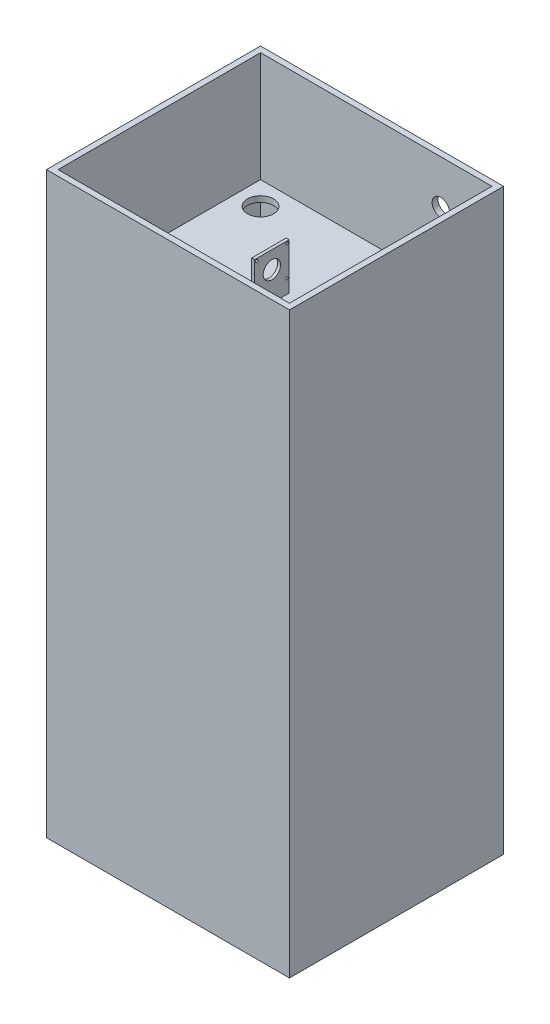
ISO-10303-21;
HEADER;
FILE_DESCRIPTION(('STEP AP214'),'2;1');
FILE_NAME('part.step','',(''),(''),'','','');
FILE_SCHEMA(('AUTOMOTIVE_DESIGN { 1 0 10303 214 1 1 1 1 }'));
ENDSEC;
DATA;
#1=APPLICATION_CONTEXT('core data for automotive mechanical design processes');
#2=APPLICATION_PROTOCOL_DEFINITION('international standard','automotive_design',2000,#1);
#3=PRODUCT_CONTEXT('',#1,'mechanical');
#4=PRODUCT('Part','Part','',(#3));
#5=PRODUCT_RELATED_PRODUCT_CATEGORY('part','',(#4));
#6=PRODUCT_DEFINITION_FORMATION('','',#4);
#7=PRODUCT_DEFINITION_CONTEXT('part definition',#1,'design');
#8=PRODUCT_DEFINITION('design','',#6,#7);
#9=PRODUCT_DEFINITION_SHAPE('','',#8);
#10=(LENGTH_UNIT() NAMED_UNIT(*) SI_UNIT(.MILLI.,.METRE.));
#11=(NAMED_UNIT(*) PLANE_ANGLE_UNIT() SI_UNIT($,.RADIAN.));
#12=(NAMED_UNIT(*) SI_UNIT($,.STERADIAN.) SOLID_ANGLE_UNIT());
#13=UNCERTAINTY_MEASURE_WITH_UNIT(LENGTH_MEASURE(1.E-05),#10,'distance_accuracy_value','');
#14=(GEOMETRIC_REPRESENTATION_CONTEXT(3) GLOBAL_UNCERTAINTY_ASSIGNED_CONTEXT((#13)) GLOBAL_UNIT_ASSIGNED_CONTEXT((#10,
#11,#12)) REPRESENTATION_CONTEXT('',''));
#15=CARTESIAN_POINT('',(0.,0.,0.));
#16=DIRECTION('',(0.,0.,1.));
#17=DIRECTION('',(1.,0.,0.));
#18=AXIS2_PLACEMENT_3D('',#15,#16,#17);
#19=CARTESIAN_POINT('',(0.,810.,0.));
#20=DIRECTION('',(0.,1.,0.));
#21=DIRECTION('',(0.,0.,1.));
#22=AXIS2_PLACEMENT_3D('',#19,#20,#21);
#23=PLANE('',#22);
#24=CARTESIAN_POINT('',(-160.,810.,-135.));
#25=DIRECTION('',(0.,1.,0.));
#26=DIRECTION('',(0.,0.,1.));
#27=AXIS2_PLACEMENT_3D('',#24,#25,#26);
#28=CIRCLE('',#27,22.5);
#29=CARTESIAN_POINT('',(-160.,810.,-112.5));
#30=VERTEX_POINT('',#29);
#31=EDGE_CURVE('E246',#30,#30,#28,.T.);
#32=ORIENTED_EDGE('',*,*,#31,.F.);
#33=EDGE_LOOP('',(#32));
#34=FACE_BOUND('',#33,.T.);
#35=DIRECTION('',(0.,0.,1.));
#36=VECTOR('',#35,1.);
#37=CARTESIAN_POINT('',(-200.,810.,-175.));
#38=LINE('',#37,#36);
#39=CARTESIAN_POINT('',(-200.,810.,-175.));
#40=VERTEX_POINT('',#39);
#41=CARTESIAN_POINT('',(-200.,810.,175.));
#42=VERTEX_POINT('',#41);
#43=EDGE_CURVE('E259',#40,#42,#38,.T.);
#44=ORIENTED_EDGE('',*,*,#43,.T.);
#45=DIRECTION('',(1.,0.,0.));
#46=VECTOR('',#45,1.);
#47=CARTESIAN_POINT('',(-200.,810.,175.));
#48=LINE('',#47,#46);
#49=CARTESIAN_POINT('',(200.,810.,175.));
#50=VERTEX_POINT('',#49);
#51=EDGE_CURVE('E262',#42,#50,#48,.T.);
#52=ORIENTED_EDGE('',*,*,#51,.T.);
#53=DIRECTION('',(0.,0.,-1.));
#54=VECTOR('',#53,1.);
#55=CARTESIAN_POINT('',(200.,810.,175.));
#56=LINE('',#55,#54);
#57=CARTESIAN_POINT('',(200.,810.,-175.));
#58=VERTEX_POINT('',#57);
#59=EDGE_CURVE('E266',#50,#58,#56,.T.);
#60=ORIENTED_EDGE('',*,*,#59,.T.);
#61=DIRECTION('',(-1.,0.,0.));
#62=VECTOR('',#61,1.);
#63=CARTESIAN_POINT('',(200.,810.,-175.));
#64=LINE('',#63,#62);
#65=EDGE_CURVE('E269',#58,#40,#64,.T.);
#66=ORIENTED_EDGE('',*,*,#65,.T.);
#67=EDGE_LOOP('',(#44,#52,#60,#66));
#68=FACE_BOUND('',#67,.T.);
#69=DIRECTION('',(1.,0.,0.));
#70=VECTOR('',#69,1.);
#71=CARTESIAN_POINT('',(-10.4074759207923,810.,30.));
#72=LINE('',#71,#70);
#73=CARTESIAN_POINT('',(-10.4074759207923,810.,30.));
#74=VERTEX_POINT('',#73);
#75=CARTESIAN_POINT('',(-5.40747592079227,810.,30.));
#76=VERTEX_POINT('',#75);
#77=EDGE_CURVE('E730',#74,#76,#72,.T.);
#78=ORIENTED_EDGE('',*,*,#77,.F.);
#79=DIRECTION('',(0.,0.,1.));
#80=VECTOR('',#79,1.);
#81=CARTESIAN_POINT('',(-10.4074759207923,810.,-30.));
#82=LINE('',#81,#80);
#83=CARTESIAN_POINT('',(-10.4074759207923,810.,-30.));
#84=VERTEX_POINT('',#83);
#85=EDGE_CURVE('E216',#84,#74,#82,.T.);
#86=ORIENTED_EDGE('',*,*,#85,.F.);
#87=DIRECTION('',(-1.,0.,0.));
#88=VECTOR('',#87,1.);
#89=CARTESIAN_POINT('',(-10.4074759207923,810.,-30.));
#90=LINE('',#89,#88);
#91=CARTESIAN_POINT('',(-5.40747592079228,810.,-30.));
#92=VERTEX_POINT('',#91);
#93=EDGE_CURVE('E212',#92,#84,#90,.T.);
#94=ORIENTED_EDGE('',*,*,#93,.F.);
#95=DIRECTION('',(0.,0.,-1.));
#96=VECTOR('',#95,1.);
#97=CARTESIAN_POINT('',(-5.40747592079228,810.,-30.));
#98=LINE('',#97,#96);
#99=EDGE_CURVE('E732',#76,#92,#98,.T.);
#100=ORIENTED_EDGE('',*,*,#99,.F.);
#101=EDGE_LOOP('',(#78,#86,#94,#100));
#102=FACE_BOUND('',#101,.T.);
#103=ADVANCED_FACE('F56',(#34,#68,#102),#23,.T.);
#104=CARTESIAN_POINT('',(200.,1000.,175.));
#105=DIRECTION('',(-1.,0.,0.));
#106=DIRECTION('',(0.,0.,1.));
#107=AXIS2_PLACEMENT_3D('',#104,#105,#106);
#108=PLANE('',#107);
#109=DIRECTION('',(0.,-1.,0.));
#110=VECTOR('',#109,1.);
#111=CARTESIAN_POINT('',(200.,1000.,175.));
#112=LINE('',#111,#110);
#113=CARTESIAN_POINT('',(200.,800.,175.));
#114=VERTEX_POINT('',#113);
#115=CARTESIAN_POINT('',(200.,0.,175.));
#116=VERTEX_POINT('',#115);
#117=EDGE_CURVE('E293',#114,#116,#112,.T.);
#118=ORIENTED_EDGE('',*,*,#117,.F.);
#119=DIRECTION('',(0.,0.,-1.));
#120=VECTOR('',#119,1.);
#121=CARTESIAN_POINT('',(200.,800.,175.));
#122=LINE('',#121,#120);
#123=CARTESIAN_POINT('',(200.,800.,-175.));
#124=VERTEX_POINT('',#123);
#125=EDGE_CURVE('E278',#114,#124,#122,.T.);
#126=ORIENTED_EDGE('',*,*,#125,.T.);
#127=DIRECTION('',(0.,-1.,0.));
#128=VECTOR('',#127,1.);
#129=CARTESIAN_POINT('',(200.,1000.,-175.));
#130=LINE('',#129,#128);
#131=CARTESIAN_POINT('',(200.,0.,-175.));
#132=VERTEX_POINT('',#131);
#133=EDGE_CURVE('E314',#124,#132,#130,.T.);
#134=ORIENTED_EDGE('',*,*,#133,.T.);
#135=DIRECTION('',(0.,0.,-1.));
#136=VECTOR('',#135,1.);
#137=CARTESIAN_POINT('',(200.,0.,175.));
#138=LINE('',#137,#136);
#139=EDGE_CURVE('E272',#116,#132,#138,.T.);
#140=ORIENTED_EDGE('',*,*,#139,.F.);
#141=EDGE_LOOP('',(#118,#126,#134,#140));
#142=FACE_BOUND('',#141,.T.);
#143=ADVANCED_FACE('F375',(#142),#108,.T.);
#144=CARTESIAN_POINT('',(-200.,1000.,-175.));
#145=DIRECTION('',(0.,0.,1.));
#146=DIRECTION('',(1.,0.,0.));
#147=AXIS2_PLACEMENT_3D('',#144,#145,#146);
#148=PLANE('',#147);
#149=ORIENTED_EDGE('',*,*,#133,.F.);
#150=DIRECTION('',(-1.,0.,0.));
#151=VECTOR('',#150,1.);
#152=CARTESIAN_POINT('',(200.,800.,-175.));
#153=LINE('',#152,#151);
#154=CARTESIAN_POINT('',(-200.,800.,-175.));
#155=VERTEX_POINT('',#154);
#156=EDGE_CURVE('E263',#124,#155,#153,.T.);
#157=ORIENTED_EDGE('',*,*,#156,.T.);
#158=DIRECTION('',(0.,-1.,0.));
#159=VECTOR('',#158,1.);
#160=CARTESIAN_POINT('',(-200.,1000.,-175.));
#161=LINE('',#160,#159);
#162=CARTESIAN_POINT('',(-200.,0.,-175.));
#163=VERTEX_POINT('',#162);
#164=EDGE_CURVE('E310',#155,#163,#161,.T.);
#165=ORIENTED_EDGE('',*,*,#164,.T.);
#166=DIRECTION('',(-1.,0.,0.));
#167=VECTOR('',#166,1.);
#168=CARTESIAN_POINT('',(-200.,0.,-175.));
#169=LINE('',#168,#167);
#170=EDGE_CURVE('E296',#132,#163,#169,.T.);
#171=ORIENTED_EDGE('',*,*,#170,.F.);
#172=EDGE_LOOP('',(#149,#157,#165,#171));
#173=FACE_BOUND('',#172,.T.);
#174=ADVANCED_FACE('F381',(#173),#148,.T.);
#175=CARTESIAN_POINT('',(-200.,1000.,175.));
#176=DIRECTION('',(1.,0.,0.));
#177=DIRECTION('',(0.,0.,-1.));
#178=AXIS2_PLACEMENT_3D('',#175,#176,#177);
#179=PLANE('',#178);
#180=DIRECTION('',(0.,0.,1.));
#181=VECTOR('',#180,1.);
#182=CARTESIAN_POINT('',(-200.,150.,150.));
#183=LINE('',#182,#181);
#184=CARTESIAN_POINT('',(-200.,150.,-150.));
#185=VERTEX_POINT('',#184);
#186=CARTESIAN_POINT('',(-200.,150.,150.));
#187=VERTEX_POINT('',#186);
#188=EDGE_CURVE('E225',#185,#187,#183,.T.);
#189=ORIENTED_EDGE('',*,*,#188,.T.);
#190=DIRECTION('',(0.,1.,0.));
#191=VECTOR('',#190,1.);
#192=CARTESIAN_POINT('',(-200.,650.,150.));
#193=LINE('',#192,#191);
#194=CARTESIAN_POINT('',(-200.,650.,150.));
#195=VERTEX_POINT('',#194);
#196=EDGE_CURVE('E228',#187,#195,#193,.T.);
#197=ORIENTED_EDGE('',*,*,#196,.T.);
#198=DIRECTION('',(0.,0.,-1.));
#199=VECTOR('',#198,1.);
#200=CARTESIAN_POINT('',(-200.,650.,-150.));
#201=LINE('',#200,#199);
#202=CARTESIAN_POINT('',(-200.,650.,-150.));
#203=VERTEX_POINT('',#202);
#204=EDGE_CURVE('E79',#195,#203,#201,.T.);
#205=ORIENTED_EDGE('',*,*,#204,.T.);
#206=DIRECTION('',(0.,-1.,0.));
#207=VECTOR('',#206,1.);
#208=CARTESIAN_POINT('',(-200.,150.,-150.));
#209=LINE('',#208,#207);
#210=EDGE_CURVE('E233',#203,#185,#209,.T.);
#211=ORIENTED_EDGE('',*,*,#210,.T.);
#212=EDGE_LOOP('',(#189,#197,#205,#211));
#213=FACE_BOUND('',#212,.T.);
#214=ORIENTED_EDGE('',*,*,#164,.F.);
#215=DIRECTION('',(0.,0.,1.));
#216=VECTOR('',#215,1.);
#217=CARTESIAN_POINT('',(-200.,800.,-175.));
#218=LINE('',#217,#216);
#219=CARTESIAN_POINT('',(-200.,800.,175.));
#220=VERTEX_POINT('',#219);
#221=EDGE_CURVE('E258',#155,#220,#218,.T.);
#222=ORIENTED_EDGE('',*,*,#221,.T.);
#223=DIRECTION('',(0.,-1.,0.));
#224=VECTOR('',#223,1.);
#225=CARTESIAN_POINT('',(-200.,1000.,175.));
#226=LINE('',#225,#224);
#227=CARTESIAN_POINT('',(-200.,0.,175.));
#228=VERTEX_POINT('',#227);
#229=EDGE_CURVE('E306',#220,#228,#226,.T.);
#230=ORIENTED_EDGE('',*,*,#229,.T.);
#231=DIRECTION('',(0.,0.,1.));
#232=VECTOR('',#231,1.);
#233=CARTESIAN_POINT('',(-200.,0.,175.));
#234=LINE('',#233,#232);
#235=EDGE_CURVE('E299',#163,#228,#234,.T.);
#236=ORIENTED_EDGE('',*,*,#235,.F.);
#237=EDGE_LOOP('',(#214,#222,#230,#236));
#238=FACE_BOUND('',#237,.T.);
#239=ADVANCED_FACE('F405',(#213,#238),#179,.T.);
#240=CARTESIAN_POINT('',(-200.,1000.,175.));
#241=DIRECTION('',(0.,0.,-1.));
#242=DIRECTION('',(-1.,0.,0.));
#243=AXIS2_PLACEMENT_3D('',#240,#241,#242);
#244=PLANE('',#243);
#245=ORIENTED_EDGE('',*,*,#229,.F.);
#246=DIRECTION('',(1.,0.,0.));
#247=VECTOR('',#246,1.);
#248=CARTESIAN_POINT('',(-200.,800.,175.));
#249=LINE('',#248,#247);
#250=EDGE_CURVE('E275',#220,#114,#249,.T.);
#251=ORIENTED_EDGE('',*,*,#250,.T.);
#252=ORIENTED_EDGE('',*,*,#117,.T.);
#253=DIRECTION('',(1.,0.,0.));
#254=VECTOR('',#253,1.);
#255=CARTESIAN_POINT('',(-200.,0.,175.));
#256=LINE('',#255,#254);
#257=EDGE_CURVE('E286',#228,#116,#256,.T.);
#258=ORIENTED_EDGE('',*,*,#257,.F.);
#259=EDGE_LOOP('',(#245,#251,#252,#258));
#260=FACE_BOUND('',#259,.T.);
#261=ADVANCED_FACE('F400',(#260),#244,.T.);
#262=CARTESIAN_POINT('',(0.,1000.,0.));
#263=DIRECTION('',(0.,1.,0.));
#264=DIRECTION('',(0.,0.,1.));
#265=AXIS2_PLACEMENT_3D('',#262,#263,#264);
#266=PLANE('',#265);
#267=DIRECTION('',(0.,0.,-1.));
#268=VECTOR('',#267,1.);
#269=CARTESIAN_POINT('',(210.,1000.,0.));
#270=LINE('',#269,#268);
#271=CARTESIAN_POINT('',(210.,1000.,185.));
#272=VERTEX_POINT('',#271);
#273=CARTESIAN_POINT('',(210.,1000.,-185.));
#274=VERTEX_POINT('',#273);
#275=EDGE_CURVE('E319',#272,#274,#270,.T.);
#276=ORIENTED_EDGE('',*,*,#275,.T.);
#277=DIRECTION('',(-1.,0.,0.));
#278=VECTOR('',#277,1.);
#279=CARTESIAN_POINT('',(0.,1000.,-185.));
#280=LINE('',#279,#278);
#281=CARTESIAN_POINT('',(-210.,1000.,-185.));
#282=VERTEX_POINT('',#281);
#283=EDGE_CURVE('E322',#274,#282,#280,.T.);
#284=ORIENTED_EDGE('',*,*,#283,.T.);
#285=DIRECTION('',(0.,0.,1.));
#286=VECTOR('',#285,1.);
#287=CARTESIAN_POINT('',(-210.,1000.,0.));
#288=LINE('',#287,#286);
#289=CARTESIAN_POINT('',(-210.,1000.,185.));
#290=VERTEX_POINT('',#289);
#291=EDGE_CURVE('E325',#282,#290,#288,.T.);
#292=ORIENTED_EDGE('',*,*,#291,.T.);
#293=DIRECTION('',(1.,0.,0.));
#294=VECTOR('',#293,1.);
#295=CARTESIAN_POINT('',(0.,1000.,185.));
#296=LINE('',#295,#294);
#297=EDGE_CURVE('E327',#290,#272,#296,.T.);
#298=ORIENTED_EDGE('',*,*,#297,.T.);
#299=EDGE_LOOP('',(#276,#284,#292,#298));
#300=FACE_BOUND('',#299,.T.);
#301=DIRECTION('',(-1.,0.,0.));
#302=VECTOR('',#301,1.);
#303=CARTESIAN_POINT('',(-200.,1000.,-175.));
#304=LINE('',#303,#302);
#305=CARTESIAN_POINT('',(200.,1000.,-175.));
#306=VERTEX_POINT('',#305);
#307=CARTESIAN_POINT('',(-200.,1000.,-175.));
#308=VERTEX_POINT('',#307);
#309=EDGE_CURVE('E285',#306,#308,#304,.T.);
#310=ORIENTED_EDGE('',*,*,#309,.F.);
#311=DIRECTION('',(0.,0.,-1.));
#312=VECTOR('',#311,1.);
#313=CARTESIAN_POINT('',(200.,1000.,175.));
#314=LINE('',#313,#312);
#315=CARTESIAN_POINT('',(200.,1000.,175.));
#316=VERTEX_POINT('',#315);
#317=EDGE_CURVE('E283',#316,#306,#314,.T.);
#318=ORIENTED_EDGE('',*,*,#317,.F.);
#319=DIRECTION('',(1.,0.,0.));
#320=VECTOR('',#319,1.);
#321=CARTESIAN_POINT('',(-200.,1000.,175.));
#322=LINE('',#321,#320);
#323=CARTESIAN_POINT('',(-200.,1000.,175.));
#324=VERTEX_POINT('',#323);
#325=EDGE_CURVE('E291',#324,#316,#322,.T.);
#326=ORIENTED_EDGE('',*,*,#325,.F.);
#327=DIRECTION('',(0.,0.,1.));
#328=VECTOR('',#327,1.);
#329=CARTESIAN_POINT('',(-200.,1000.,175.));
#330=LINE('',#329,#328);
#331=EDGE_CURVE('E288',#308,#324,#330,.T.);
#332=ORIENTED_EDGE('',*,*,#331,.F.);
#333=EDGE_LOOP('',(#310,#318,#326,#332));
#334=FACE_BOUND('',#333,.T.);
#335=ADVANCED_FACE('F362',(#300,#334),#266,.T.);
#336=CARTESIAN_POINT('',(0.,0.,0.));
#337=DIRECTION('',(0.,1.,0.));
#338=DIRECTION('',(0.,0.,1.));
#339=AXIS2_PLACEMENT_3D('',#336,#337,#338);
#340=PLANE('',#339);
#341=DIRECTION('',(0.,0.,-1.));
#342=VECTOR('',#341,1.);
#343=CARTESIAN_POINT('',(210.,0.,0.));
#344=LINE('',#343,#342);
#345=CARTESIAN_POINT('',(210.,0.,185.));
#346=VERTEX_POINT('',#345);
#347=CARTESIAN_POINT('',(210.,0.,-185.));
#348=VERTEX_POINT('',#347);
#349=EDGE_CURVE('E318',#346,#348,#344,.T.);
#350=ORIENTED_EDGE('',*,*,#349,.F.);
#351=DIRECTION('',(1.,0.,0.));
#352=VECTOR('',#351,1.);
#353=CARTESIAN_POINT('',(0.,0.,185.));
#354=LINE('',#353,#352);
#355=CARTESIAN_POINT('',(-210.,0.,185.));
#356=VERTEX_POINT('',#355);
#357=EDGE_CURVE('E323',#356,#346,#354,.T.);
#358=ORIENTED_EDGE('',*,*,#357,.F.);
#359=DIRECTION('',(0.,0.,1.));
#360=VECTOR('',#359,1.);
#361=CARTESIAN_POINT('',(-210.,0.,0.));
#362=LINE('',#361,#360);
#363=CARTESIAN_POINT('',(-210.,0.,-185.));
#364=VERTEX_POINT('',#363);
#365=EDGE_CURVE('E334',#364,#356,#362,.T.);
#366=ORIENTED_EDGE('',*,*,#365,.F.);
#367=DIRECTION('',(-1.,0.,0.));
#368=VECTOR('',#367,1.);
#369=CARTESIAN_POINT('',(0.,0.,-185.));
#370=LINE('',#369,#368);
#371=EDGE_CURVE('E332',#348,#364,#370,.T.);
#372=ORIENTED_EDGE('',*,*,#371,.F.);
#373=EDGE_LOOP('',(#350,#358,#366,#372));
#374=FACE_BOUND('',#373,.T.);
#375=ORIENTED_EDGE('',*,*,#139,.T.);
#376=ORIENTED_EDGE('',*,*,#170,.T.);
#377=ORIENTED_EDGE('',*,*,#235,.T.);
#378=ORIENTED_EDGE('',*,*,#257,.T.);
#379=EDGE_LOOP('',(#375,#376,#377,#378));
#380=FACE_BOUND('',#379,.T.);
#381=ADVANCED_FACE('F352',(#374,#380),#340,.F.);
#382=CARTESIAN_POINT('',(210.,1000.,0.));
#383=DIRECTION('',(-1.,0.,0.));
#384=DIRECTION('',(0.,0.,1.));
#385=AXIS2_PLACEMENT_3D('',#382,#383,#384);
#386=PLANE('',#385);
#387=ORIENTED_EDGE('',*,*,#349,.T.);
#388=DIRECTION('',(0.,-1.,0.));
#389=VECTOR('',#388,1.);
#390=CARTESIAN_POINT('',(210.,1000.,-185.));
#391=LINE('',#390,#389);
#392=EDGE_CURVE('E12',#274,#348,#391,.T.);
#393=ORIENTED_EDGE('',*,*,#392,.F.);
#394=ORIENTED_EDGE('',*,*,#275,.F.);
#395=DIRECTION('',(0.,-1.,0.));
#396=VECTOR('',#395,1.);
#397=CARTESIAN_POINT('',(210.,1000.,185.));
#398=LINE('',#397,#396);
#399=EDGE_CURVE('E329',#272,#346,#398,.T.);
#400=ORIENTED_EDGE('',*,*,#399,.T.);
#401=EDGE_LOOP('',(#387,#393,#394,#400));
#402=FACE_BOUND('',#401,.T.);
#403=ADVANCED_FACE('F58',(#402),#386,.F.);
#404=CARTESIAN_POINT('',(0.,1000.,-185.));
#405=DIRECTION('',(0.,0.,1.));
#406=DIRECTION('',(1.,0.,0.));
#407=AXIS2_PLACEMENT_3D('',#404,#405,#406);
#408=PLANE('',#407);
#409=CARTESIAN_POINT('',(111.59,924.18,-185.));
#410=DIRECTION('',(0.,0.,-1.));
#411=DIRECTION('',(-1.,0.,0.));
#412=AXIS2_PLACEMENT_3D('',#409,#410,#411);
#413=CIRCLE('',#412,15.);
#414=CARTESIAN_POINT('',(96.5900000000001,924.18,-185.));
#415=VERTEX_POINT('',#414);
#416=EDGE_CURVE('E692',#415,#415,#413,.T.);
#417=ORIENTED_EDGE('',*,*,#416,.F.);
#418=EDGE_LOOP('',(#417));
#419=FACE_BOUND('',#418,.T.);
#420=ORIENTED_EDGE('',*,*,#371,.T.);
#421=DIRECTION('',(0.,-1.,0.));
#422=VECTOR('',#421,1.);
#423=CARTESIAN_POINT('',(-210.,1000.,-185.));
#424=LINE('',#423,#422);
#425=EDGE_CURVE('E64',#282,#364,#424,.T.);
#426=ORIENTED_EDGE('',*,*,#425,.F.);
#427=ORIENTED_EDGE('',*,*,#283,.F.);
#428=ORIENTED_EDGE('',*,*,#392,.T.);
#429=EDGE_LOOP('',(#420,#426,#427,#428));
#430=FACE_BOUND('',#429,.T.);
#431=ADVANCED_FACE('F364',(#419,#430),#408,.F.);
#432=CARTESIAN_POINT('',(-210.,1000.,0.));
#433=DIRECTION('',(1.,0.,0.));
#434=DIRECTION('',(0.,0.,-1.));
#435=AXIS2_PLACEMENT_3D('',#432,#433,#434);
#436=PLANE('',#435);
#437=DIRECTION('',(0.,1.,0.));
#438=VECTOR('',#437,1.);
#439=CARTESIAN_POINT('',(-210.,650.,150.));
#440=LINE('',#439,#438);
#441=CARTESIAN_POINT('',(-210.,150.,150.));
#442=VERTEX_POINT('',#441);
#443=CARTESIAN_POINT('',(-210.,650.,150.));
#444=VERTEX_POINT('',#443);
#445=EDGE_CURVE('E220',#442,#444,#440,.T.);
#446=ORIENTED_EDGE('',*,*,#445,.F.);
#447=DIRECTION('',(0.,0.,1.));
#448=VECTOR('',#447,1.);
#449=CARTESIAN_POINT('',(-210.,150.,150.));
#450=LINE('',#449,#448);
#451=CARTESIAN_POINT('',(-210.,150.,-150.));
#452=VERTEX_POINT('',#451);
#453=EDGE_CURVE('E218',#452,#442,#450,.T.);
#454=ORIENTED_EDGE('',*,*,#453,.F.);
#455=DIRECTION('',(0.,-1.,0.));
#456=VECTOR('',#455,1.);
#457=CARTESIAN_POINT('',(-210.,150.,-150.));
#458=LINE('',#457,#456);
#459=CARTESIAN_POINT('',(-210.,650.,-150.));
#460=VERTEX_POINT('',#459);
#461=EDGE_CURVE('E229',#460,#452,#458,.T.);
#462=ORIENTED_EDGE('',*,*,#461,.F.);
#463=DIRECTION('',(0.,0.,-1.));
#464=VECTOR('',#463,1.);
#465=CARTESIAN_POINT('',(-210.,650.,-150.));
#466=LINE('',#465,#464);
#467=EDGE_CURVE('E239',#444,#460,#466,.T.);
#468=ORIENTED_EDGE('',*,*,#467,.F.);
#469=EDGE_LOOP('',(#446,#454,#462,#468));
#470=FACE_BOUND('',#469,.T.);
#471=ORIENTED_EDGE('',*,*,#365,.T.);
#472=DIRECTION('',(0.,-1.,0.));
#473=VECTOR('',#472,1.);
#474=CARTESIAN_POINT('',(-210.,1000.,185.));
#475=LINE('',#474,#473);
#476=EDGE_CURVE('E339',#290,#356,#475,.T.);
#477=ORIENTED_EDGE('',*,*,#476,.F.);
#478=ORIENTED_EDGE('',*,*,#291,.F.);
#479=ORIENTED_EDGE('',*,*,#425,.T.);
#480=EDGE_LOOP('',(#471,#477,#478,#479));
#481=FACE_BOUND('',#480,.T.);
#482=ADVANCED_FACE('F346',(#470,#481),#436,.F.);
#483=CARTESIAN_POINT('',(0.,1000.,185.));
#484=DIRECTION('',(0.,0.,-1.));
#485=DIRECTION('',(-1.,0.,0.));
#486=AXIS2_PLACEMENT_3D('',#483,#484,#485);
#487=PLANE('',#486);
#488=ORIENTED_EDGE('',*,*,#357,.T.);
#489=ORIENTED_EDGE('',*,*,#399,.F.);
#490=ORIENTED_EDGE('',*,*,#297,.F.);
#491=ORIENTED_EDGE('',*,*,#476,.T.);
#492=EDGE_LOOP('',(#488,#489,#490,#491));
#493=FACE_BOUND('',#492,.T.);
#494=ADVANCED_FACE('F356',(#493),#487,.F.);
#495=ORIENTED_EDGE('',*,*,#59,.F.);
#496=EDGE_CURVE('E304',#316,#50,#112,.T.);
#497=ORIENTED_EDGE('',*,*,#496,.F.);
#498=ORIENTED_EDGE('',*,*,#317,.T.);
#499=EDGE_CURVE('E315',#306,#58,#130,.T.);
#500=ORIENTED_EDGE('',*,*,#499,.T.);
#501=EDGE_LOOP('',(#495,#497,#498,#500));
#502=FACE_BOUND('',#501,.T.);
#503=ADVANCED_FACE('F384',(#502),#108,.T.);
#504=CARTESIAN_POINT('',(111.59,924.18,-175.));
#505=DIRECTION('',(0.,0.,-1.));
#506=DIRECTION('',(-1.,0.,0.));
#507=AXIS2_PLACEMENT_3D('',#504,#505,#506);
#508=CIRCLE('',#507,15.);
#509=CARTESIAN_POINT('',(96.5900000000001,924.18,-175.));
#510=VERTEX_POINT('',#509);
#511=EDGE_CURVE('E690',#510,#510,#508,.T.);
#512=ORIENTED_EDGE('',*,*,#511,.T.);
#513=EDGE_LOOP('',(#512));
#514=FACE_BOUND('',#513,.T.);
#515=ORIENTED_EDGE('',*,*,#65,.F.);
#516=ORIENTED_EDGE('',*,*,#499,.F.);
#517=ORIENTED_EDGE('',*,*,#309,.T.);
#518=EDGE_CURVE('E311',#308,#40,#161,.T.);
#519=ORIENTED_EDGE('',*,*,#518,.T.);
#520=EDGE_LOOP('',(#515,#516,#517,#519));
#521=FACE_BOUND('',#520,.T.);
#522=ADVANCED_FACE('F403',(#514,#521),#148,.T.);
#523=ORIENTED_EDGE('',*,*,#43,.F.);
#524=ORIENTED_EDGE('',*,*,#518,.F.);
#525=ORIENTED_EDGE('',*,*,#331,.T.);
#526=EDGE_CURVE('E307',#324,#42,#226,.T.);
#527=ORIENTED_EDGE('',*,*,#526,.T.);
#528=EDGE_LOOP('',(#523,#524,#525,#527));
#529=FACE_BOUND('',#528,.T.);
#530=ADVANCED_FACE('F398',(#529),#179,.T.);
#531=ORIENTED_EDGE('',*,*,#51,.F.);
#532=ORIENTED_EDGE('',*,*,#526,.F.);
#533=ORIENTED_EDGE('',*,*,#325,.T.);
#534=ORIENTED_EDGE('',*,*,#496,.T.);
#535=EDGE_LOOP('',(#531,#532,#533,#534));
#536=FACE_BOUND('',#535,.T.);
#537=ADVANCED_FACE('F394',(#536),#244,.T.);
#538=CARTESIAN_POINT('',(0.,800.,0.));
#539=DIRECTION('',(0.,1.,0.));
#540=DIRECTION('',(0.,0.,1.));
#541=AXIS2_PLACEMENT_3D('',#538,#539,#540);
#542=PLANE('',#541);
#543=CARTESIAN_POINT('',(-160.,800.,-135.));
#544=DIRECTION('',(0.,1.,0.));
#545=DIRECTION('',(0.,0.,1.));
#546=AXIS2_PLACEMENT_3D('',#543,#544,#545);
#547=CIRCLE('',#546,22.5);
#548=CARTESIAN_POINT('',(-160.,800.,-112.5));
#549=VERTEX_POINT('',#548);
#550=EDGE_CURVE('E255',#549,#549,#547,.T.);
#551=ORIENTED_EDGE('',*,*,#550,.T.);
#552=EDGE_LOOP('',(#551));
#553=FACE_BOUND('',#552,.T.);
#554=ORIENTED_EDGE('',*,*,#221,.F.);
#555=ORIENTED_EDGE('',*,*,#156,.F.);
#556=ORIENTED_EDGE('',*,*,#125,.F.);
#557=ORIENTED_EDGE('',*,*,#250,.F.);
#558=EDGE_LOOP('',(#554,#555,#556,#557));
#559=FACE_BOUND('',#558,.T.);
#560=ADVANCED_FACE('F391',(#553,#559),#542,.F.);
#561=CARTESIAN_POINT('',(-160.,790.,-135.));
#562=DIRECTION('',(0.,1.,0.));
#563=DIRECTION('',(0.,0.,1.));
#564=AXIS2_PLACEMENT_3D('',#561,#562,#563);
#565=CYLINDRICAL_SURFACE('',#564,22.5);
#566=ORIENTED_EDGE('',*,*,#31,.T.);
#567=EDGE_LOOP('',(#566));
#568=FACE_BOUND('',#567,.T.);
#569=ORIENTED_EDGE('',*,*,#550,.F.);
#570=EDGE_LOOP('',(#569));
#571=FACE_BOUND('',#570,.T.);
#572=ADVANCED_FACE('F389',(#568,#571),#565,.F.);
#573=CARTESIAN_POINT('',(-200.,150.,150.));
#574=DIRECTION('',(0.,-1.,0.));
#575=DIRECTION('',(0.,0.,-1.));
#576=AXIS2_PLACEMENT_3D('',#573,#574,#575);
#577=PLANE('',#576);
#578=ORIENTED_EDGE('',*,*,#453,.T.);
#579=DIRECTION('',(-1.,0.,0.));
#580=VECTOR('',#579,1.);
#581=CARTESIAN_POINT('',(-200.,150.,150.));
#582=LINE('',#581,#580);
#583=EDGE_CURVE('E235',#187,#442,#582,.T.);
#584=ORIENTED_EDGE('',*,*,#583,.F.);
#585=ORIENTED_EDGE('',*,*,#188,.F.);
#586=DIRECTION('',(-1.,0.,0.));
#587=VECTOR('',#586,1.);
#588=CARTESIAN_POINT('',(-200.,150.,-150.));
#589=LINE('',#588,#587);
#590=EDGE_CURVE('E244',#185,#452,#589,.T.);
#591=ORIENTED_EDGE('',*,*,#590,.T.);
#592=EDGE_LOOP('',(#578,#584,#585,#591));
#593=FACE_BOUND('',#592,.T.);
#594=ADVANCED_FACE('F450',(#593),#577,.F.);
#595=CARTESIAN_POINT('',(-200.,150.,-150.));
#596=DIRECTION('',(0.,0.,-1.));
#597=DIRECTION('',(0.,1.,0.));
#598=AXIS2_PLACEMENT_3D('',#595,#596,#597);
#599=PLANE('',#598);
#600=ORIENTED_EDGE('',*,*,#461,.T.);
#601=ORIENTED_EDGE('',*,*,#590,.F.);
#602=ORIENTED_EDGE('',*,*,#210,.F.);
#603=DIRECTION('',(-1.,0.,0.));
#604=VECTOR('',#603,1.);
#605=CARTESIAN_POINT('',(-200.,650.,-150.));
#606=LINE('',#605,#604);
#607=EDGE_CURVE('E247',#203,#460,#606,.T.);
#608=ORIENTED_EDGE('',*,*,#607,.T.);
#609=EDGE_LOOP('',(#600,#601,#602,#608));
#610=FACE_BOUND('',#609,.T.);
#611=ADVANCED_FACE('F458',(#610),#599,.F.);
#612=CARTESIAN_POINT('',(-200.,650.,-150.));
#613=DIRECTION('',(0.,1.,0.));
#614=DIRECTION('',(0.,0.,1.));
#615=AXIS2_PLACEMENT_3D('',#612,#613,#614);
#616=PLANE('',#615);
#617=ORIENTED_EDGE('',*,*,#467,.T.);
#618=ORIENTED_EDGE('',*,*,#607,.F.);
#619=ORIENTED_EDGE('',*,*,#204,.F.);
#620=DIRECTION('',(-1.,0.,0.));
#621=VECTOR('',#620,1.);
#622=CARTESIAN_POINT('',(-200.,650.,150.));
#623=LINE('',#622,#621);
#624=EDGE_CURVE('E249',#195,#444,#623,.T.);
#625=ORIENTED_EDGE('',*,*,#624,.T.);
#626=EDGE_LOOP('',(#617,#618,#619,#625));
#627=FACE_BOUND('',#626,.T.);
#628=ADVANCED_FACE('F465',(#627),#616,.F.);
#629=CARTESIAN_POINT('',(-200.,650.,150.));
#630=DIRECTION('',(0.,0.,1.));
#631=DIRECTION('',(0.,-1.,0.));
#632=AXIS2_PLACEMENT_3D('',#629,#630,#631);
#633=PLANE('',#632);
#634=ORIENTED_EDGE('',*,*,#445,.T.);
#635=ORIENTED_EDGE('',*,*,#624,.F.);
#636=ORIENTED_EDGE('',*,*,#196,.F.);
#637=ORIENTED_EDGE('',*,*,#583,.T.);
#638=EDGE_LOOP('',(#634,#635,#636,#637));
#639=FACE_BOUND('',#638,.T.);
#640=ADVANCED_FACE('F473',(#639),#633,.F.);
#641=CARTESIAN_POINT('',(-10.4074759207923,890.,-30.));
#642=DIRECTION('',(1.,0.,0.));
#643=DIRECTION('',(0.,0.,-1.));
#644=AXIS2_PLACEMENT_3D('',#641,#642,#643);
#645=PLANE('',#644);
#646=CARTESIAN_POINT('',(-10.4074759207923,860.,0.));
#647=DIRECTION('',(1.,0.,0.));
#648=DIRECTION('',(0.,0.,-1.));
#649=AXIS2_PLACEMENT_3D('',#646,#647,#648);
#650=CIRCLE('',#649,15.);
#651=CARTESIAN_POINT('',(-10.4074759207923,860.,-15.));
#652=VERTEX_POINT('',#651);
#653=EDGE_CURVE('E699',#652,#652,#650,.T.);
#654=ORIENTED_EDGE('',*,*,#653,.T.);
#655=EDGE_LOOP('',(#654));
#656=FACE_BOUND('',#655,.T.);
#657=CARTESIAN_POINT('',(-10.4074759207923,834.,-26.));
#658=DIRECTION('',(-1.,0.,0.));
#659=DIRECTION('',(0.,0.,1.));
#660=AXIS2_PLACEMENT_3D('',#657,#658,#659);
#661=CIRCLE('',#660,2.);
#662=CARTESIAN_POINT('',(-10.4074759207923,834.,-24.));
#663=VERTEX_POINT('',#662);
#664=EDGE_CURVE('E702',#663,#663,#661,.T.);
#665=ORIENTED_EDGE('',*,*,#664,.F.);
#666=EDGE_LOOP('',(#665));
#667=FACE_BOUND('',#666,.T.);
#668=CARTESIAN_POINT('',(-10.4074759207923,886.,-26.));
#669=DIRECTION('',(-1.,0.,0.));
#670=DIRECTION('',(0.,0.,1.));
#671=AXIS2_PLACEMENT_3D('',#668,#669,#670);
#672=CIRCLE('',#671,2.);
#673=CARTESIAN_POINT('',(-10.4074759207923,886.,-24.));
#674=VERTEX_POINT('',#673);
#675=EDGE_CURVE('E708',#674,#674,#672,.T.);
#676=ORIENTED_EDGE('',*,*,#675,.F.);
#677=EDGE_LOOP('',(#676));
#678=FACE_BOUND('',#677,.T.);
#679=CARTESIAN_POINT('',(-10.4074759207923,886.,26.));
#680=DIRECTION('',(-1.,0.,0.));
#681=DIRECTION('',(0.,0.,1.));
#682=AXIS2_PLACEMENT_3D('',#679,#680,#681);
#683=CIRCLE('',#682,2.);
#684=CARTESIAN_POINT('',(-10.4074759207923,886.,28.));
#685=VERTEX_POINT('',#684);
#686=EDGE_CURVE('E714',#685,#685,#683,.T.);
#687=ORIENTED_EDGE('',*,*,#686,.F.);
#688=EDGE_LOOP('',(#687));
#689=FACE_BOUND('',#688,.T.);
#690=CARTESIAN_POINT('',(-10.4074759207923,834.,26.));
#691=DIRECTION('',(-1.,0.,0.));
#692=DIRECTION('',(0.,0.,1.));
#693=AXIS2_PLACEMENT_3D('',#690,#691,#692);
#694=CIRCLE('',#693,2.);
#695=CARTESIAN_POINT('',(-10.4074759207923,834.,28.0000000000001));
#696=VERTEX_POINT('',#695);
#697=EDGE_CURVE('E720',#696,#696,#694,.T.);
#698=ORIENTED_EDGE('',*,*,#697,.F.);
#699=EDGE_LOOP('',(#698));
#700=FACE_BOUND('',#699,.T.);
#701=ORIENTED_EDGE('',*,*,#85,.T.);
#702=DIRECTION('',(0.,-1.,0.));
#703=VECTOR('',#702,1.);
#704=CARTESIAN_POINT('',(-10.4074759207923,890.,30.));
#705=LINE('',#704,#703);
#706=CARTESIAN_POINT('',(-10.4074759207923,890.,30.));
#707=VERTEX_POINT('',#706);
#708=EDGE_CURVE('E197',#707,#74,#705,.T.);
#709=ORIENTED_EDGE('',*,*,#708,.F.);
#710=DIRECTION('',(0.,0.,1.));
#711=VECTOR('',#710,1.);
#712=CARTESIAN_POINT('',(-10.4074759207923,890.,-30.));
#713=LINE('',#712,#711);
#714=CARTESIAN_POINT('',(-10.4074759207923,890.,-30.));
#715=VERTEX_POINT('',#714);
#716=EDGE_CURVE('E204',#715,#707,#713,.T.);
#717=ORIENTED_EDGE('',*,*,#716,.F.);
#718=DIRECTION('',(0.,-1.,0.));
#719=VECTOR('',#718,1.);
#720=CARTESIAN_POINT('',(-10.4074759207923,890.,-30.));
#721=LINE('',#720,#719);
#722=EDGE_CURVE('E728',#715,#84,#721,.T.);
#723=ORIENTED_EDGE('',*,*,#722,.T.);
#724=EDGE_LOOP('',(#701,#709,#717,#723));
#725=FACE_BOUND('',#724,.T.);
#726=ADVANCED_FACE('F214',(#656,#667,#678,#689,#700,#725),#645,.F.);
#727=CARTESIAN_POINT('',(-10.4074759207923,890.,30.));
#728=DIRECTION('',(0.,0.,-1.));
#729=DIRECTION('',(-1.,0.,0.));
#730=AXIS2_PLACEMENT_3D('',#727,#728,#729);
#731=PLANE('',#730);
#732=ORIENTED_EDGE('',*,*,#77,.T.);
#733=DIRECTION('',(0.,-1.,0.));
#734=VECTOR('',#733,1.);
#735=CARTESIAN_POINT('',(-5.40747592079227,890.,30.));
#736=LINE('',#735,#734);
#737=CARTESIAN_POINT('',(-5.40747592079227,890.,30.));
#738=VERTEX_POINT('',#737);
#739=EDGE_CURVE('E200',#738,#76,#736,.T.);
#740=ORIENTED_EDGE('',*,*,#739,.F.);
#741=DIRECTION('',(1.,0.,0.));
#742=VECTOR('',#741,1.);
#743=CARTESIAN_POINT('',(-10.4074759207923,890.,30.));
#744=LINE('',#743,#742);
#745=EDGE_CURVE('E193',#707,#738,#744,.T.);
#746=ORIENTED_EDGE('',*,*,#745,.F.);
#747=ORIENTED_EDGE('',*,*,#708,.T.);
#748=EDGE_LOOP('',(#732,#740,#746,#747));
#749=FACE_BOUND('',#748,.T.);
#750=ADVANCED_FACE('F195',(#749),#731,.F.);
#751=CARTESIAN_POINT('',(-5.40747592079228,890.,-30.));
#752=DIRECTION('',(-1.,0.,0.));
#753=DIRECTION('',(0.,0.,1.));
#754=AXIS2_PLACEMENT_3D('',#751,#752,#753);
#755=PLANE('',#754);
#756=CARTESIAN_POINT('',(-5.40747592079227,860.,0.));
#757=DIRECTION('',(1.,0.,0.));
#758=DIRECTION('',(0.,0.,-1.));
#759=AXIS2_PLACEMENT_3D('',#756,#757,#758);
#760=CIRCLE('',#759,15.);
#761=CARTESIAN_POINT('',(-5.40747592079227,860.,-15.));
#762=VERTEX_POINT('',#761);
#763=EDGE_CURVE('E694',#762,#762,#760,.T.);
#764=ORIENTED_EDGE('',*,*,#763,.F.);
#765=EDGE_LOOP('',(#764));
#766=FACE_BOUND('',#765,.T.);
#767=CARTESIAN_POINT('',(-5.40747592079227,834.,-26.));
#768=DIRECTION('',(-1.,0.,0.));
#769=DIRECTION('',(0.,0.,1.));
#770=AXIS2_PLACEMENT_3D('',#767,#768,#769);
#771=CIRCLE('',#770,2.);
#772=CARTESIAN_POINT('',(-5.40747592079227,834.,-24.));
#773=VERTEX_POINT('',#772);
#774=EDGE_CURVE('E705',#773,#773,#771,.T.);
#775=ORIENTED_EDGE('',*,*,#774,.T.);
#776=EDGE_LOOP('',(#775));
#777=FACE_BOUND('',#776,.T.);
#778=CARTESIAN_POINT('',(-5.40747592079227,886.,-26.));
#779=DIRECTION('',(-1.,0.,0.));
#780=DIRECTION('',(0.,0.,1.));
#781=AXIS2_PLACEMENT_3D('',#778,#779,#780);
#782=CIRCLE('',#781,2.);
#783=CARTESIAN_POINT('',(-5.40747592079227,886.,-24.));
#784=VERTEX_POINT('',#783);
#785=EDGE_CURVE('E711',#784,#784,#782,.T.);
#786=ORIENTED_EDGE('',*,*,#785,.T.);
#787=EDGE_LOOP('',(#786));
#788=FACE_BOUND('',#787,.T.);
#789=CARTESIAN_POINT('',(-5.40747592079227,886.,26.));
#790=DIRECTION('',(-1.,0.,0.));
#791=DIRECTION('',(0.,0.,1.));
#792=AXIS2_PLACEMENT_3D('',#789,#790,#791);
#793=CIRCLE('',#792,2.);
#794=CARTESIAN_POINT('',(-5.40747592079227,886.,28.));
#795=VERTEX_POINT('',#794);
#796=EDGE_CURVE('E717',#795,#795,#793,.T.);
#797=ORIENTED_EDGE('',*,*,#796,.T.);
#798=EDGE_LOOP('',(#797));
#799=FACE_BOUND('',#798,.T.);
#800=CARTESIAN_POINT('',(-5.40747592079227,834.,26.));
#801=DIRECTION('',(-1.,0.,0.));
#802=DIRECTION('',(0.,0.,1.));
#803=AXIS2_PLACEMENT_3D('',#800,#801,#802);
#804=CIRCLE('',#803,2.);
#805=CARTESIAN_POINT('',(-5.40747592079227,834.,28.0000000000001));
#806=VERTEX_POINT('',#805);
#807=EDGE_CURVE('E723',#806,#806,#804,.T.);
#808=ORIENTED_EDGE('',*,*,#807,.T.);
#809=EDGE_LOOP('',(#808));
#810=FACE_BOUND('',#809,.T.);
#811=ORIENTED_EDGE('',*,*,#99,.T.);
#812=DIRECTION('',(0.,-1.,0.));
#813=VECTOR('',#812,1.);
#814=CARTESIAN_POINT('',(-5.40747592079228,890.,-30.));
#815=LINE('',#814,#813);
#816=CARTESIAN_POINT('',(-5.40747592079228,890.,-30.));
#817=VERTEX_POINT('',#816);
#818=EDGE_CURVE('E71',#817,#92,#815,.T.);
#819=ORIENTED_EDGE('',*,*,#818,.F.);
#820=DIRECTION('',(0.,0.,-1.));
#821=VECTOR('',#820,1.);
#822=CARTESIAN_POINT('',(-5.40747592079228,890.,-30.));
#823=LINE('',#822,#821);
#824=EDGE_CURVE('E203',#738,#817,#823,.T.);
#825=ORIENTED_EDGE('',*,*,#824,.F.);
#826=ORIENTED_EDGE('',*,*,#739,.T.);
#827=EDGE_LOOP('',(#811,#819,#825,#826));
#828=FACE_BOUND('',#827,.T.);
#829=ADVANCED_FACE('F497',(#766,#777,#788,#799,#810,#828),#755,.F.);
#830=CARTESIAN_POINT('',(-10.4074759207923,890.,-30.));
#831=DIRECTION('',(0.,0.,1.));
#832=DIRECTION('',(1.,0.,0.));
#833=AXIS2_PLACEMENT_3D('',#830,#831,#832);
#834=PLANE('',#833);
#835=ORIENTED_EDGE('',*,*,#93,.T.);
#836=ORIENTED_EDGE('',*,*,#722,.F.);
#837=DIRECTION('',(-1.,0.,0.));
#838=VECTOR('',#837,1.);
#839=CARTESIAN_POINT('',(-10.4074759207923,890.,-30.));
#840=LINE('',#839,#838);
#841=EDGE_CURVE('E208',#817,#715,#840,.T.);
#842=ORIENTED_EDGE('',*,*,#841,.F.);
#843=ORIENTED_EDGE('',*,*,#818,.T.);
#844=EDGE_LOOP('',(#835,#836,#842,#843));
#845=FACE_BOUND('',#844,.T.);
#846=ADVANCED_FACE('F504',(#845),#834,.F.);
#847=CARTESIAN_POINT('',(0.,890.,0.));
#848=DIRECTION('',(0.,1.,0.));
#849=DIRECTION('',(0.,0.,1.));
#850=AXIS2_PLACEMENT_3D('',#847,#848,#849);
#851=PLANE('',#850);
#852=ORIENTED_EDGE('',*,*,#716,.T.);
#853=ORIENTED_EDGE('',*,*,#745,.T.);
#854=ORIENTED_EDGE('',*,*,#824,.T.);
#855=ORIENTED_EDGE('',*,*,#841,.T.);
#856=EDGE_LOOP('',(#852,#853,#854,#855));
#857=FACE_BOUND('',#856,.T.);
#858=ADVANCED_FACE('F207',(#857),#851,.T.);
#859=CARTESIAN_POINT('',(-10.4074759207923,834.,26.));
#860=DIRECTION('',(-1.,0.,0.));
#861=DIRECTION('',(0.,0.,1.));
#862=AXIS2_PLACEMENT_3D('',#859,#860,#861);
#863=CYLINDRICAL_SURFACE('',#862,2.);
#864=ORIENTED_EDGE('',*,*,#697,.T.);
#865=EDGE_LOOP('',(#864));
#866=FACE_BOUND('',#865,.T.);
#867=ORIENTED_EDGE('',*,*,#807,.F.);
#868=EDGE_LOOP('',(#867));
#869=FACE_BOUND('',#868,.T.);
#870=ADVANCED_FACE('F518',(#866,#869),#863,.F.);
#871=CARTESIAN_POINT('',(-10.4074759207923,886.,26.));
#872=DIRECTION('',(-1.,0.,0.));
#873=DIRECTION('',(0.,0.,1.));
#874=AXIS2_PLACEMENT_3D('',#871,#872,#873);
#875=CYLINDRICAL_SURFACE('',#874,2.);
#876=ORIENTED_EDGE('',*,*,#686,.T.);
#877=EDGE_LOOP('',(#876));
#878=FACE_BOUND('',#877,.T.);
#879=ORIENTED_EDGE('',*,*,#796,.F.);
#880=EDGE_LOOP('',(#879));
#881=FACE_BOUND('',#880,.T.);
#882=ADVANCED_FACE('F525',(#878,#881),#875,.F.);
#883=CARTESIAN_POINT('',(-10.4074759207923,886.,-26.));
#884=DIRECTION('',(-1.,0.,0.));
#885=DIRECTION('',(0.,0.,1.));
#886=AXIS2_PLACEMENT_3D('',#883,#884,#885);
#887=CYLINDRICAL_SURFACE('',#886,2.);
#888=ORIENTED_EDGE('',*,*,#675,.T.);
#889=EDGE_LOOP('',(#888));
#890=FACE_BOUND('',#889,.T.);
#891=ORIENTED_EDGE('',*,*,#785,.F.);
#892=EDGE_LOOP('',(#891));
#893=FACE_BOUND('',#892,.T.);
#894=ADVANCED_FACE('F533',(#890,#893),#887,.F.);
#895=CARTESIAN_POINT('',(-10.4074759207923,834.,-26.));
#896=DIRECTION('',(-1.,0.,0.));
#897=DIRECTION('',(0.,0.,1.));
#898=AXIS2_PLACEMENT_3D('',#895,#896,#897);
#899=CYLINDRICAL_SURFACE('',#898,2.);
#900=ORIENTED_EDGE('',*,*,#664,.T.);
#901=EDGE_LOOP('',(#900));
#902=FACE_BOUND('',#901,.T.);
#903=ORIENTED_EDGE('',*,*,#774,.F.);
#904=EDGE_LOOP('',(#903));
#905=FACE_BOUND('',#904,.T.);
#906=ADVANCED_FACE('F541',(#902,#905),#899,.F.);
#907=CARTESIAN_POINT('',(-15.4074759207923,860.,0.));
#908=DIRECTION('',(1.,0.,0.));
#909=DIRECTION('',(0.,0.,-1.));
#910=AXIS2_PLACEMENT_3D('',#907,#908,#909);
#911=CYLINDRICAL_SURFACE('',#910,15.);
#912=ORIENTED_EDGE('',*,*,#763,.T.);
#913=EDGE_LOOP('',(#912));
#914=FACE_BOUND('',#913,.T.);
#915=ORIENTED_EDGE('',*,*,#653,.F.);
#916=EDGE_LOOP('',(#915));
#917=FACE_BOUND('',#916,.T.);
#918=ADVANCED_FACE('F548',(#914,#917),#911,.F.);
#919=CARTESIAN_POINT('',(111.59,924.18,-175.));
#920=DIRECTION('',(0.,0.,-1.));
#921=DIRECTION('',(-1.,0.,0.));
#922=AXIS2_PLACEMENT_3D('',#919,#920,#921);
#923=CYLINDRICAL_SURFACE('',#922,15.);
#924=ORIENTED_EDGE('',*,*,#511,.F.);
#925=EDGE_LOOP('',(#924));
#926=FACE_BOUND('',#925,.T.);
#927=ORIENTED_EDGE('',*,*,#416,.T.);
#928=EDGE_LOOP('',(#927));
#929=FACE_BOUND('',#928,.T.);
#930=ADVANCED_FACE('F555',(#926,#929),#923,.F.);
#931=CLOSED_SHELL('',(#103,#143,#174,#239,#261,#335,#381,#403,#431,#482,#494,#503,#522,#530,
#537,#560,#572,#594,#611,#628,#640,#726,#750,#829,#846,#858,#870,#882,#894,#906,#918,#930));
#932=MANIFOLD_SOLID_BREP('B2',#931);
#933=ADVANCED_BREP_SHAPE_REPRESENTATION('',(#18,#932),#14);
#934=SHAPE_DEFINITION_REPRESENTATION(#9,#933);
ENDSEC;
END-ISO-10303-21;
